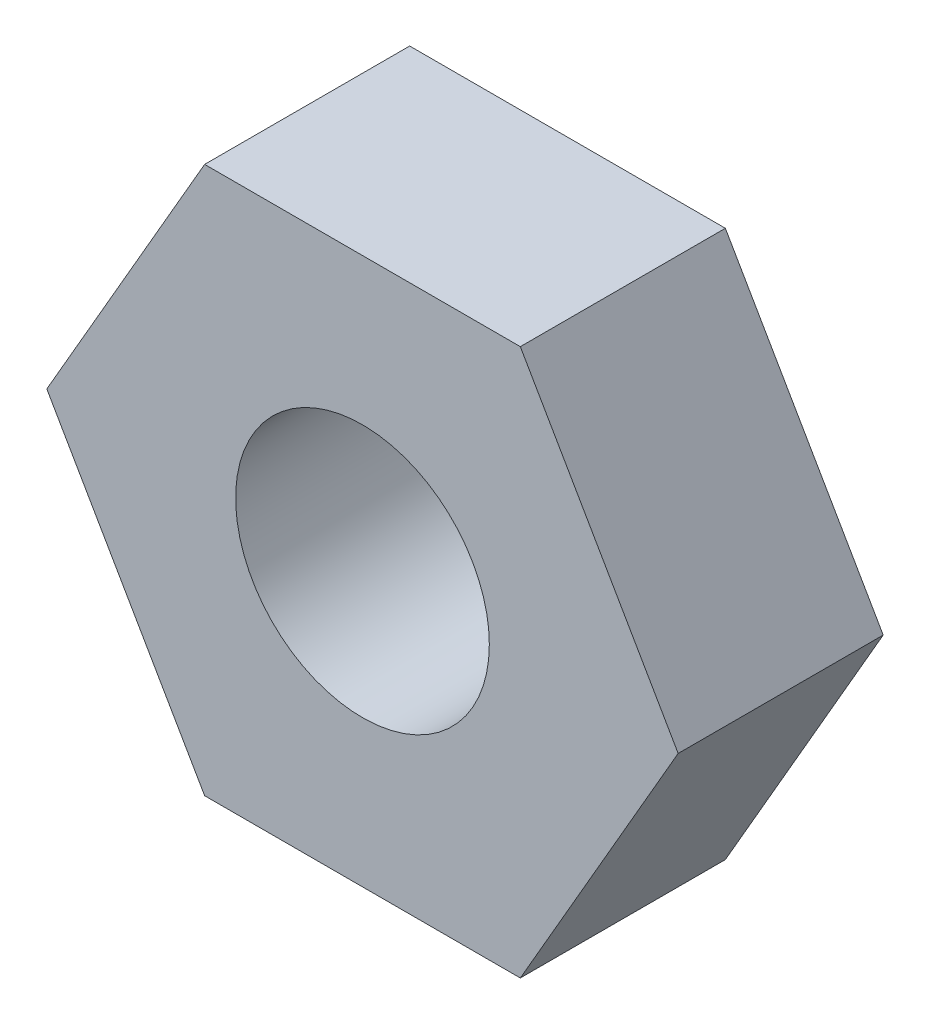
ISO-10303-21;
HEADER;
FILE_DESCRIPTION(('STEP AP214'),'2;1');
FILE_NAME('part.step','',(''),(''),'','','');
FILE_SCHEMA(('AUTOMOTIVE_DESIGN { 1 0 10303 214 1 1 1 1 }'));
ENDSEC;
DATA;
#1=APPLICATION_CONTEXT('core data for automotive mechanical design processes');
#2=APPLICATION_PROTOCOL_DEFINITION('international standard','automotive_design',2000,#1);
#3=PRODUCT_CONTEXT('',#1,'mechanical');
#4=PRODUCT('Part','Part','',(#3));
#5=PRODUCT_RELATED_PRODUCT_CATEGORY('part','',(#4));
#6=PRODUCT_DEFINITION_FORMATION('','',#4);
#7=PRODUCT_DEFINITION_CONTEXT('part definition',#1,'design');
#8=PRODUCT_DEFINITION('design','',#6,#7);
#9=PRODUCT_DEFINITION_SHAPE('','',#8);
#10=(LENGTH_UNIT() NAMED_UNIT(*) SI_UNIT(.MILLI.,.METRE.));
#11=(NAMED_UNIT(*) PLANE_ANGLE_UNIT() SI_UNIT($,.RADIAN.));
#12=(NAMED_UNIT(*) SI_UNIT($,.STERADIAN.) SOLID_ANGLE_UNIT());
#13=UNCERTAINTY_MEASURE_WITH_UNIT(LENGTH_MEASURE(1.E-05),#10,'distance_accuracy_value','');
#14=(GEOMETRIC_REPRESENTATION_CONTEXT(3) GLOBAL_UNCERTAINTY_ASSIGNED_CONTEXT((#13)) GLOBAL_UNIT_ASSIGNED_CONTEXT((#10,
#11,#12)) REPRESENTATION_CONTEXT('',''));
#15=CARTESIAN_POINT('',(0.,0.,0.));
#16=DIRECTION('',(0.,0.,1.));
#17=DIRECTION('',(1.,0.,0.));
#18=AXIS2_PLACEMENT_3D('',#15,#16,#17);
#19=CARTESIAN_POINT('',(3.66617420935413,0.,2.38125));
#20=DIRECTION('',(-0.866025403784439,-0.5,0.));
#21=DIRECTION('',(0.5,-0.866025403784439,0.));
#22=AXIS2_PLACEMENT_3D('',#19,#20,#21);
#23=PLANE('',#22);
#24=DIRECTION('',(-0.5,0.866025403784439,0.));
#25=VECTOR('',#24,1.);
#26=CARTESIAN_POINT('',(3.66617420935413,0.,0.));
#27=LINE('',#26,#25);
#28=CARTESIAN_POINT('',(3.66617420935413,0.,0.));
#29=VERTEX_POINT('',#28);
#30=CARTESIAN_POINT('',(1.83308710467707,3.175,0.));
#31=VERTEX_POINT('',#30);
#32=EDGE_CURVE('E117',#29,#31,#27,.T.);
#33=ORIENTED_EDGE('',*,*,#32,.T.);
#34=DIRECTION('',(0.,0.,-1.));
#35=VECTOR('',#34,1.);
#36=CARTESIAN_POINT('',(1.83308710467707,3.175,2.38125));
#37=LINE('',#36,#35);
#38=CARTESIAN_POINT('',(1.83308710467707,3.175,2.38125));
#39=VERTEX_POINT('',#38);
#40=EDGE_CURVE('E11',#39,#31,#37,.T.);
#41=ORIENTED_EDGE('',*,*,#40,.F.);
#42=DIRECTION('',(-0.5,0.866025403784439,0.));
#43=VECTOR('',#42,1.);
#44=CARTESIAN_POINT('',(3.66617420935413,0.,2.38125));
#45=LINE('',#44,#43);
#46=CARTESIAN_POINT('',(3.66617420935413,0.,2.38125));
#47=VERTEX_POINT('',#46);
#48=EDGE_CURVE('E128',#47,#39,#45,.T.);
#49=ORIENTED_EDGE('',*,*,#48,.F.);
#50=DIRECTION('',(0.,0.,-1.));
#51=VECTOR('',#50,1.);
#52=CARTESIAN_POINT('',(3.66617420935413,0.,2.38125));
#53=LINE('',#52,#51);
#54=EDGE_CURVE('E113',#47,#29,#53,.T.);
#55=ORIENTED_EDGE('',*,*,#54,.T.);
#56=EDGE_LOOP('',(#33,#41,#49,#55));
#57=FACE_BOUND('',#56,.T.);
#58=ADVANCED_FACE('F33',(#57),#23,.F.);
#59=CARTESIAN_POINT('',(1.83308710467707,3.175,2.38125));
#60=DIRECTION('',(0.,-1.,0.));
#61=DIRECTION('',(0.,0.,-1.));
#62=AXIS2_PLACEMENT_3D('',#59,#60,#61);
#63=PLANE('',#62);
#64=DIRECTION('',(-1.,0.,0.));
#65=VECTOR('',#64,1.);
#66=CARTESIAN_POINT('',(1.83308710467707,3.175,0.));
#67=LINE('',#66,#65);
#68=CARTESIAN_POINT('',(-1.83308710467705,3.175,0.));
#69=VERTEX_POINT('',#68);
#70=EDGE_CURVE('E120',#31,#69,#67,.T.);
#71=ORIENTED_EDGE('',*,*,#70,.T.);
#72=DIRECTION('',(0.,0.,-1.));
#73=VECTOR('',#72,1.);
#74=CARTESIAN_POINT('',(-1.83308710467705,3.175,2.38125));
#75=LINE('',#74,#73);
#76=CARTESIAN_POINT('',(-1.83308710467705,3.175,2.38125));
#77=VERTEX_POINT('',#76);
#78=EDGE_CURVE('E41',#77,#69,#75,.T.);
#79=ORIENTED_EDGE('',*,*,#78,.F.);
#80=DIRECTION('',(-1.,0.,0.));
#81=VECTOR('',#80,1.);
#82=CARTESIAN_POINT('',(1.83308710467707,3.175,2.38125));
#83=LINE('',#82,#81);
#84=EDGE_CURVE('E86',#39,#77,#83,.T.);
#85=ORIENTED_EDGE('',*,*,#84,.F.);
#86=ORIENTED_EDGE('',*,*,#40,.T.);
#87=EDGE_LOOP('',(#71,#79,#85,#86));
#88=FACE_BOUND('',#87,.T.);
#89=ADVANCED_FACE('F153',(#88),#63,.F.);
#90=CARTESIAN_POINT('',(-1.83308710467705,3.175,2.38125));
#91=DIRECTION('',(0.866025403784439,-0.5,0.));
#92=DIRECTION('',(0.5,0.866025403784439,0.));
#93=AXIS2_PLACEMENT_3D('',#90,#91,#92);
#94=PLANE('',#93);
#95=DIRECTION('',(-0.5,-0.866025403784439,0.));
#96=VECTOR('',#95,1.);
#97=CARTESIAN_POINT('',(-1.83308710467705,3.175,0.));
#98=LINE('',#97,#96);
#99=CARTESIAN_POINT('',(-3.66617420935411,0.,0.));
#100=VERTEX_POINT('',#99);
#101=EDGE_CURVE('E123',#69,#100,#98,.T.);
#102=ORIENTED_EDGE('',*,*,#101,.T.);
#103=DIRECTION('',(0.,0.,-1.));
#104=VECTOR('',#103,1.);
#105=CARTESIAN_POINT('',(-3.66617420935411,0.,2.38125));
#106=LINE('',#105,#104);
#107=CARTESIAN_POINT('',(-3.66617420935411,0.,2.38125));
#108=VERTEX_POINT('',#107);
#109=EDGE_CURVE('E108',#108,#100,#106,.T.);
#110=ORIENTED_EDGE('',*,*,#109,.F.);
#111=DIRECTION('',(-0.5,-0.866025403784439,0.));
#112=VECTOR('',#111,1.);
#113=CARTESIAN_POINT('',(-1.83308710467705,3.175,2.38125));
#114=LINE('',#113,#112);
#115=EDGE_CURVE('E99',#77,#108,#114,.T.);
#116=ORIENTED_EDGE('',*,*,#115,.F.);
#117=ORIENTED_EDGE('',*,*,#78,.T.);
#118=EDGE_LOOP('',(#102,#110,#116,#117));
#119=FACE_BOUND('',#118,.T.);
#120=ADVANCED_FACE('F134',(#119),#94,.F.);
#121=CARTESIAN_POINT('',(-3.66617420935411,0.,2.38125));
#122=DIRECTION('',(0.866025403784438,0.500000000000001,0.));
#123=DIRECTION('',(-0.500000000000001,0.866025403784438,0.));
#124=AXIS2_PLACEMENT_3D('',#121,#122,#123);
#125=PLANE('',#124);
#126=DIRECTION('',(0.500000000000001,-0.866025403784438,0.));
#127=VECTOR('',#126,1.);
#128=CARTESIAN_POINT('',(-3.66617420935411,0.,0.));
#129=LINE('',#128,#127);
#130=CARTESIAN_POINT('',(-1.83308710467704,-3.17500000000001,0.));
#131=VERTEX_POINT('',#130);
#132=EDGE_CURVE('E107',#100,#131,#129,.T.);
#133=ORIENTED_EDGE('',*,*,#132,.T.);
#134=DIRECTION('',(0.,0.,-1.));
#135=VECTOR('',#134,1.);
#136=CARTESIAN_POINT('',(-1.83308710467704,-3.17500000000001,2.38125));
#137=LINE('',#136,#135);
#138=CARTESIAN_POINT('',(-1.83308710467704,-3.17500000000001,2.38125));
#139=VERTEX_POINT('',#138);
#140=EDGE_CURVE('E104',#139,#131,#137,.T.);
#141=ORIENTED_EDGE('',*,*,#140,.F.);
#142=DIRECTION('',(0.500000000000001,-0.866025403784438,0.));
#143=VECTOR('',#142,1.);
#144=CARTESIAN_POINT('',(-3.66617420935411,0.,2.38125));
#145=LINE('',#144,#143);
#146=EDGE_CURVE('E93',#108,#139,#145,.T.);
#147=ORIENTED_EDGE('',*,*,#146,.F.);
#148=ORIENTED_EDGE('',*,*,#109,.T.);
#149=EDGE_LOOP('',(#133,#141,#147,#148));
#150=FACE_BOUND('',#149,.T.);
#151=ADVANCED_FACE('F105',(#150),#125,.F.);
#152=CARTESIAN_POINT('',(-1.83308710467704,-3.17500000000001,2.38125));
#153=DIRECTION('',(0.,1.,0.));
#154=DIRECTION('',(-1.,0.,0.));
#155=AXIS2_PLACEMENT_3D('',#152,#153,#154);
#156=PLANE('',#155);
#157=DIRECTION('',(1.,0.,0.));
#158=VECTOR('',#157,1.);
#159=CARTESIAN_POINT('',(-1.83308710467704,-3.17500000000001,0.));
#160=LINE('',#159,#158);
#161=CARTESIAN_POINT('',(1.83308710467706,-3.175,0.));
#162=VERTEX_POINT('',#161);
#163=EDGE_CURVE('E72',#131,#162,#160,.T.);
#164=ORIENTED_EDGE('',*,*,#163,.T.);
#165=DIRECTION('',(0.,0.,-1.));
#166=VECTOR('',#165,1.);
#167=CARTESIAN_POINT('',(1.83308710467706,-3.175,2.38125));
#168=LINE('',#167,#166);
#169=CARTESIAN_POINT('',(1.83308710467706,-3.175,2.38125));
#170=VERTEX_POINT('',#169);
#171=EDGE_CURVE('E109',#170,#162,#168,.T.);
#172=ORIENTED_EDGE('',*,*,#171,.F.);
#173=DIRECTION('',(1.,0.,0.));
#174=VECTOR('',#173,1.);
#175=CARTESIAN_POINT('',(-1.83308710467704,-3.17500000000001,2.38125));
#176=LINE('',#175,#174);
#177=EDGE_CURVE('E97',#139,#170,#176,.T.);
#178=ORIENTED_EDGE('',*,*,#177,.F.);
#179=ORIENTED_EDGE('',*,*,#140,.T.);
#180=EDGE_LOOP('',(#164,#172,#178,#179));
#181=FACE_BOUND('',#180,.T.);
#182=ADVANCED_FACE('F111',(#181),#156,.F.);
#183=CARTESIAN_POINT('',(1.83308710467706,-3.175,2.38125));
#184=DIRECTION('',(-0.866025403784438,0.500000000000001,0.));
#185=DIRECTION('',(-0.500000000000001,-0.866025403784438,0.));
#186=AXIS2_PLACEMENT_3D('',#183,#184,#185);
#187=PLANE('',#186);
#188=DIRECTION('',(0.500000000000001,0.866025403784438,0.));
#189=VECTOR('',#188,1.);
#190=CARTESIAN_POINT('',(1.83308710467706,-3.175,0.));
#191=LINE('',#190,#189);
#192=EDGE_CURVE('E78',#162,#29,#191,.T.);
#193=ORIENTED_EDGE('',*,*,#192,.T.);
#194=ORIENTED_EDGE('',*,*,#54,.F.);
#195=DIRECTION('',(0.500000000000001,0.866025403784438,0.));
#196=VECTOR('',#195,1.);
#197=CARTESIAN_POINT('',(1.83308710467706,-3.175,2.38125));
#198=LINE('',#197,#196);
#199=EDGE_CURVE('E49',#170,#47,#198,.T.);
#200=ORIENTED_EDGE('',*,*,#199,.F.);
#201=ORIENTED_EDGE('',*,*,#171,.T.);
#202=EDGE_LOOP('',(#193,#194,#200,#201));
#203=FACE_BOUND('',#202,.T.);
#204=ADVANCED_FACE('F141',(#203),#187,.F.);
#205=CARTESIAN_POINT('',(0.,0.,2.38125));
#206=DIRECTION('',(0.,0.,1.));
#207=DIRECTION('',(1.,0.,0.));
#208=AXIS2_PLACEMENT_3D('',#205,#206,#207);
#209=PLANE('',#208);
#210=CARTESIAN_POINT('',(0.,0.,2.38125));
#211=DIRECTION('',(0.,0.,1.));
#212=DIRECTION('',(1.,0.,0.));
#213=AXIS2_PLACEMENT_3D('',#210,#211,#212);
#214=CIRCLE('',#213,1.47319999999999);
#215=CARTESIAN_POINT('',(1.47319999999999,0.,2.38125));
#216=VERTEX_POINT('',#215);
#217=EDGE_CURVE('E208',#216,#216,#214,.T.);
#218=ORIENTED_EDGE('',*,*,#217,.F.);
#219=EDGE_LOOP('',(#218));
#220=FACE_BOUND('',#219,.T.);
#221=ORIENTED_EDGE('',*,*,#48,.T.);
#222=ORIENTED_EDGE('',*,*,#84,.T.);
#223=ORIENTED_EDGE('',*,*,#115,.T.);
#224=ORIENTED_EDGE('',*,*,#146,.T.);
#225=ORIENTED_EDGE('',*,*,#177,.T.);
#226=ORIENTED_EDGE('',*,*,#199,.T.);
#227=EDGE_LOOP('',(#221,#222,#223,#224,#225,#226));
#228=FACE_BOUND('',#227,.T.);
#229=ADVANCED_FACE('F95',(#220,#228),#209,.T.);
#230=CARTESIAN_POINT('',(0.,0.,0.));
#231=DIRECTION('',(0.,0.,1.));
#232=DIRECTION('',(1.,0.,0.));
#233=AXIS2_PLACEMENT_3D('',#230,#231,#232);
#234=PLANE('',#233);
#235=CARTESIAN_POINT('',(0.,0.,0.));
#236=DIRECTION('',(0.,0.,1.));
#237=DIRECTION('',(1.,0.,0.));
#238=AXIS2_PLACEMENT_3D('',#235,#236,#237);
#239=CIRCLE('',#238,1.4732);
#240=CARTESIAN_POINT('',(1.4732,0.,0.));
#241=VERTEX_POINT('',#240);
#242=EDGE_CURVE('E121',#241,#241,#239,.T.);
#243=ORIENTED_EDGE('',*,*,#242,.T.);
#244=EDGE_LOOP('',(#243));
#245=FACE_BOUND('',#244,.T.);
#246=ORIENTED_EDGE('',*,*,#32,.F.);
#247=ORIENTED_EDGE('',*,*,#192,.F.);
#248=ORIENTED_EDGE('',*,*,#163,.F.);
#249=ORIENTED_EDGE('',*,*,#132,.F.);
#250=ORIENTED_EDGE('',*,*,#101,.F.);
#251=ORIENTED_EDGE('',*,*,#70,.F.);
#252=EDGE_LOOP('',(#246,#247,#248,#249,#250,#251));
#253=FACE_BOUND('',#252,.T.);
#254=ADVANCED_FACE('F137',(#245,#253),#234,.F.);
#255=CARTESIAN_POINT('',(0.,0.,2.38125));
#256=DIRECTION('',(0.,0.,1.));
#257=DIRECTION('',(1.,0.,0.));
#258=AXIS2_PLACEMENT_3D('',#255,#256,#257);
#259=CYLINDRICAL_SURFACE('',#258,1.47319999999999);
#260=ORIENTED_EDGE('',*,*,#242,.F.);
#261=EDGE_LOOP('',(#260));
#262=FACE_BOUND('',#261,.T.);
#263=ORIENTED_EDGE('',*,*,#217,.T.);
#264=EDGE_LOOP('',(#263));
#265=FACE_BOUND('',#264,.T.);
#266=ADVANCED_FACE('F190',(#262,#265),#259,.F.);
#267=CLOSED_SHELL('',(#58,#89,#120,#151,#182,#204,#229,#254,#266));
#268=MANIFOLD_SOLID_BREP('B2',#267);
#269=ADVANCED_BREP_SHAPE_REPRESENTATION('',(#18,#268),#14);
#270=SHAPE_DEFINITION_REPRESENTATION(#9,#269);
ENDSEC;
END-ISO-10303-21;
